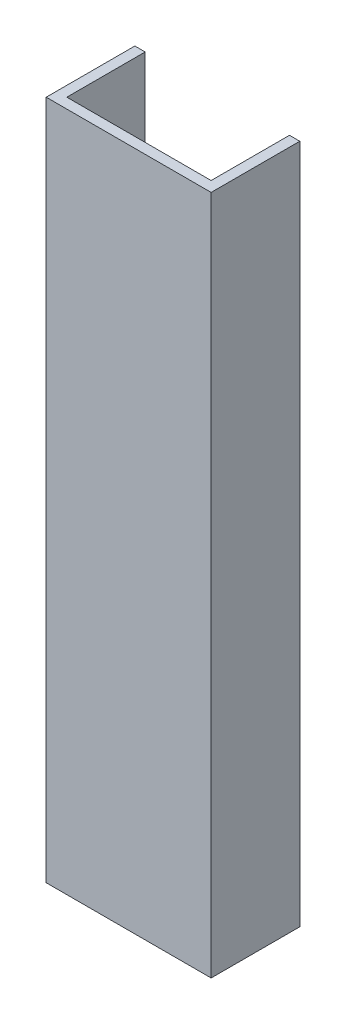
from build123d import *

# Parameters (mm, degrees)
BOSS_EXTRUDE1_DEPTH = 330


with BuildPart() as part:
    # Sketch1 → Boss-Extrude1 (new body)
    with BuildSketch(Plane(origin=(0, 0, 0), x_dir=(1, 0, 0), z_dir=(0, 1, 0))):
        Polygon((35, 43), (35, 5), (-35, 5), (-35, 43), (-40, 43), (-40, 0), (40, 0), (40, 43), align=None)
    extrude(amount=BOSS_EXTRUDE1_DEPTH)


solid = part.part
